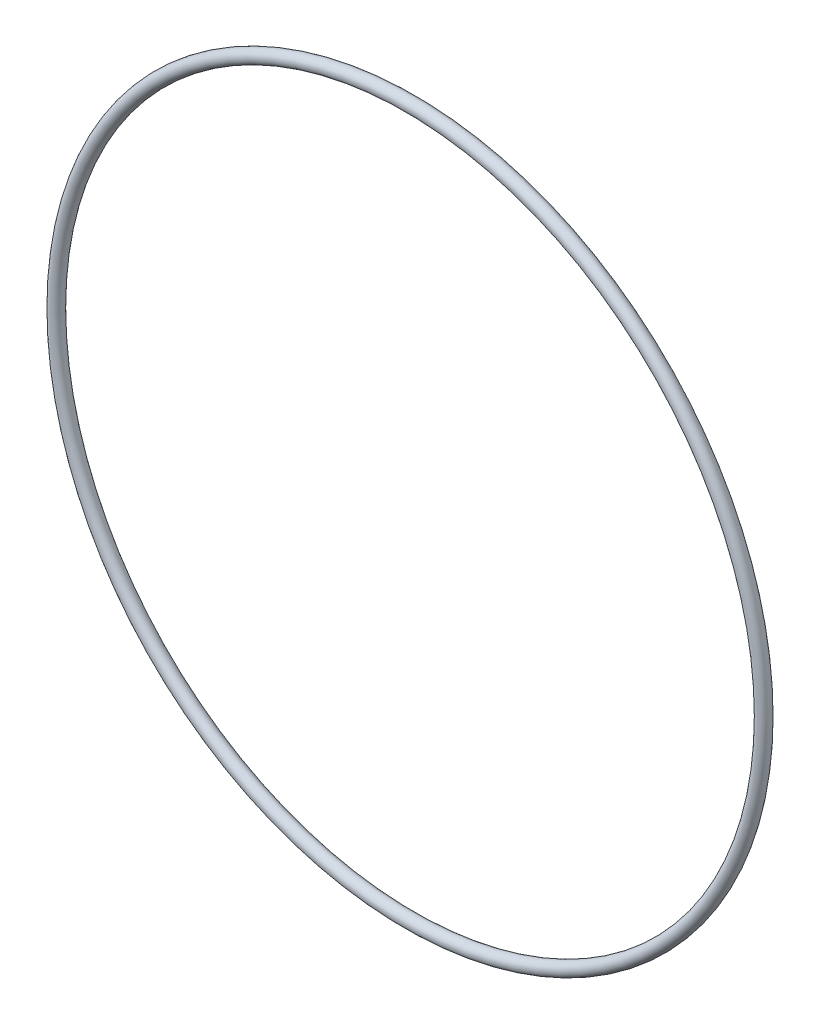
from build123d import *

# Parameters (mm, degrees)
SKETCH1_R = 2.667


with BuildPart() as part:
    # Sketch1 → Revolve1 (revolve)
    with BuildSketch(Plane(origin=(0, 0, 0), x_dir=(0, -1, 0), z_dir=(1, 0, 0)), mode=Mode.PRIVATE) as revolve1_sk:
        with Locations((142.0495, 0)):
            Circle(SKETCH1_R)
    revolve(revolve1_sk.sketch.rotate(Axis((0, 0, 2.667), (0, 0, -1)), 270), axis=Axis((0, 0, 2.667), (0, 0, -1)))


solid = part.part
